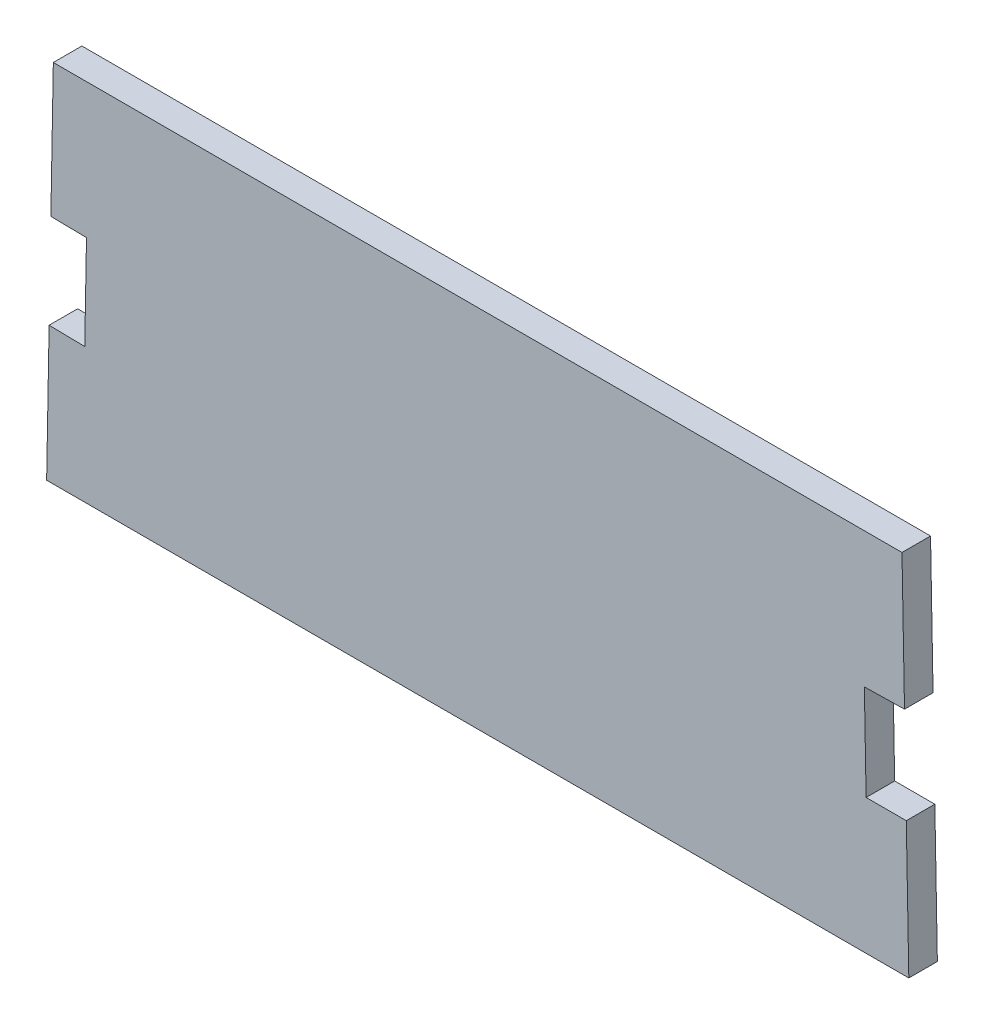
ISO-10303-21;
HEADER;
FILE_DESCRIPTION(('STEP AP214'),'2;1');
FILE_NAME('part.step','',(''),(''),'','','');
FILE_SCHEMA(('AUTOMOTIVE_DESIGN { 1 0 10303 214 1 1 1 1 }'));
ENDSEC;
DATA;
#1=APPLICATION_CONTEXT('core data for automotive mechanical design processes');
#2=APPLICATION_PROTOCOL_DEFINITION('international standard','automotive_design',2000,#1);
#3=PRODUCT_CONTEXT('',#1,'mechanical');
#4=PRODUCT('Part','Part','',(#3));
#5=PRODUCT_RELATED_PRODUCT_CATEGORY('part','',(#4));
#6=PRODUCT_DEFINITION_FORMATION('','',#4);
#7=PRODUCT_DEFINITION_CONTEXT('part definition',#1,'design');
#8=PRODUCT_DEFINITION('design','',#6,#7);
#9=PRODUCT_DEFINITION_SHAPE('','',#8);
#10=(LENGTH_UNIT() NAMED_UNIT(*) SI_UNIT(.MILLI.,.METRE.));
#11=(NAMED_UNIT(*) PLANE_ANGLE_UNIT() SI_UNIT($,.RADIAN.));
#12=(NAMED_UNIT(*) SI_UNIT($,.STERADIAN.) SOLID_ANGLE_UNIT());
#13=UNCERTAINTY_MEASURE_WITH_UNIT(LENGTH_MEASURE(1.E-05),#10,'distance_accuracy_value','');
#14=(GEOMETRIC_REPRESENTATION_CONTEXT(3) GLOBAL_UNCERTAINTY_ASSIGNED_CONTEXT((#13)) GLOBAL_UNIT_ASSIGNED_CONTEXT((#10,
#11,#12)) REPRESENTATION_CONTEXT('',''));
#15=CARTESIAN_POINT('',(0.,0.,0.));
#16=DIRECTION('',(0.,0.,1.));
#17=DIRECTION('',(1.,0.,0.));
#18=AXIS2_PLACEMENT_3D('',#15,#16,#17);
#19=CARTESIAN_POINT('',(-22.7861972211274,2.56628579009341,1.524));
#20=DIRECTION('',(0.999832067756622,-0.0183258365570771,0.));
#21=DIRECTION('',(0.0183258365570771,0.999832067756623,0.));
#22=AXIS2_PLACEMENT_3D('',#19,#20,#21);
#23=PLANE('',#22);
#24=DIRECTION('',(-0.0183258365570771,-0.999832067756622,0.));
#25=VECTOR('',#24,1.);
#26=CARTESIAN_POINT('',(-22.7861972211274,2.56628579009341,0.));
#27=LINE('',#26,#25);
#28=CARTESIAN_POINT('',(-22.6546157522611,9.7451871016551,0.));
#29=VERTEX_POINT('',#28);
#30=CARTESIAN_POINT('',(-22.7861972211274,2.56628579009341,0.));
#31=VERTEX_POINT('',#30);
#32=EDGE_CURVE('E154',#29,#31,#27,.T.);
#33=ORIENTED_EDGE('',*,*,#32,.T.);
#34=DIRECTION('',(0.,0.,-1.));
#35=VECTOR('',#34,1.);
#36=CARTESIAN_POINT('',(-22.7861972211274,2.56628579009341,1.524));
#37=LINE('',#36,#35);
#38=CARTESIAN_POINT('',(-22.7861972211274,2.56628579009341,1.524));
#39=VERTEX_POINT('',#38);
#40=EDGE_CURVE('E11',#39,#31,#37,.T.);
#41=ORIENTED_EDGE('',*,*,#40,.F.);
#42=DIRECTION('',(-0.0183258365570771,-0.999832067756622,0.));
#43=VECTOR('',#42,1.);
#44=CARTESIAN_POINT('',(-22.7861972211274,2.56628579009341,1.524));
#45=LINE('',#44,#43);
#46=CARTESIAN_POINT('',(-22.6546157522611,9.7451871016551,1.524));
#47=VERTEX_POINT('',#46);
#48=EDGE_CURVE('E176',#47,#39,#45,.T.);
#49=ORIENTED_EDGE('',*,*,#48,.F.);
#50=DIRECTION('',(0.,0.,-1.));
#51=VECTOR('',#50,1.);
#52=CARTESIAN_POINT('',(-22.6546157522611,9.7451871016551,1.524));
#53=LINE('',#52,#51);
#54=EDGE_CURVE('E150',#47,#29,#53,.T.);
#55=ORIENTED_EDGE('',*,*,#54,.T.);
#56=EDGE_LOOP('',(#33,#41,#49,#55));
#57=FACE_BOUND('',#56,.T.);
#58=ADVANCED_FACE('F34',(#57),#23,.F.);
#59=CARTESIAN_POINT('',(-22.7861972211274,2.56628579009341,1.524));
#60=DIRECTION('',(0.018325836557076,0.999832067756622,0.));
#61=DIRECTION('',(-0.999832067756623,0.018325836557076,0.));
#62=AXIS2_PLACEMENT_3D('',#59,#60,#61);
#63=PLANE('',#62);
#64=DIRECTION('',(0.999832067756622,-0.018325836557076,0.));
#65=VECTOR('',#64,1.);
#66=CARTESIAN_POINT('',(-22.7861972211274,2.56628579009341,0.));
#67=LINE('',#66,#65);
#68=CARTESIAN_POINT('',(-20.884043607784,2.53142137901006,0.));
#69=VERTEX_POINT('',#68);
#70=EDGE_CURVE('E157',#31,#69,#67,.T.);
#71=ORIENTED_EDGE('',*,*,#70,.T.);
#72=DIRECTION('',(0.,0.,-1.));
#73=VECTOR('',#72,1.);
#74=CARTESIAN_POINT('',(-20.884043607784,2.53142137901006,1.524));
#75=LINE('',#74,#73);
#76=CARTESIAN_POINT('',(-20.884043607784,2.53142137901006,1.524));
#77=VERTEX_POINT('',#76);
#78=EDGE_CURVE('E42',#77,#69,#75,.T.);
#79=ORIENTED_EDGE('',*,*,#78,.F.);
#80=DIRECTION('',(0.999832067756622,-0.018325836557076,0.));
#81=VECTOR('',#80,1.);
#82=CARTESIAN_POINT('',(-22.7861972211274,2.56628579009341,1.524));
#83=LINE('',#82,#81);
#84=EDGE_CURVE('E105',#39,#77,#83,.T.);
#85=ORIENTED_EDGE('',*,*,#84,.F.);
#86=ORIENTED_EDGE('',*,*,#40,.T.);
#87=EDGE_LOOP('',(#71,#79,#85,#86));
#88=FACE_BOUND('',#87,.T.);
#89=ADVANCED_FACE('F254',(#88),#63,.F.);
#90=CARTESIAN_POINT('',(-20.884043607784,2.53142137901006,1.524));
#91=DIRECTION('',(0.999832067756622,-0.0183258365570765,0.));
#92=DIRECTION('',(0.0183258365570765,0.999832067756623,0.));
#93=AXIS2_PLACEMENT_3D('',#90,#91,#92);
#94=PLANE('',#93);
#95=DIRECTION('',(-0.0183258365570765,-0.999832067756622,0.));
#96=VECTOR('',#95,1.);
#97=CARTESIAN_POINT('',(-20.884043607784,2.53142137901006,0.));
#98=LINE('',#97,#96);
#99=CARTESIAN_POINT('',(-20.9771388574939,-2.54772552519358,0.));
#100=VERTEX_POINT('',#99);
#101=EDGE_CURVE('E159',#69,#100,#98,.T.);
#102=ORIENTED_EDGE('',*,*,#101,.T.);
#103=DIRECTION('',(0.,0.,-1.));
#104=VECTOR('',#103,1.);
#105=CARTESIAN_POINT('',(-20.9771388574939,-2.54772552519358,1.524));
#106=LINE('',#105,#104);
#107=CARTESIAN_POINT('',(-20.9771388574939,-2.54772552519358,1.524));
#108=VERTEX_POINT('',#107);
#109=EDGE_CURVE('E195',#108,#100,#106,.T.);
#110=ORIENTED_EDGE('',*,*,#109,.F.);
#111=DIRECTION('',(-0.0183258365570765,-0.999832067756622,0.));
#112=VECTOR('',#111,1.);
#113=CARTESIAN_POINT('',(-20.884043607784,2.53142137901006,1.524));
#114=LINE('',#113,#112);
#115=EDGE_CURVE('E203',#77,#108,#114,.T.);
#116=ORIENTED_EDGE('',*,*,#115,.F.);
#117=ORIENTED_EDGE('',*,*,#78,.T.);
#118=EDGE_LOOP('',(#102,#110,#116,#117));
#119=FACE_BOUND('',#118,.T.);
#120=ADVANCED_FACE('F201',(#119),#94,.F.);
#121=CARTESIAN_POINT('',(-20.9771388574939,-2.54772552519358,1.524));
#122=DIRECTION('',(-0.018325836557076,-0.999832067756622,0.));
#123=DIRECTION('',(0.999832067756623,-0.018325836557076,0.));
#124=AXIS2_PLACEMENT_3D('',#121,#122,#123);
#125=PLANE('',#124);
#126=DIRECTION('',(-0.999832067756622,0.018325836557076,0.));
#127=VECTOR('',#126,1.);
#128=CARTESIAN_POINT('',(-20.9771388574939,-2.54772552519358,0.));
#129=LINE('',#128,#127);
#130=CARTESIAN_POINT('',(-22.8792924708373,-2.51286111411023,0.));
#131=VERTEX_POINT('',#130);
#132=EDGE_CURVE('E161',#100,#131,#129,.T.);
#133=ORIENTED_EDGE('',*,*,#132,.T.);
#134=DIRECTION('',(0.,0.,-1.));
#135=VECTOR('',#134,1.);
#136=CARTESIAN_POINT('',(-22.8792924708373,-2.51286111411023,1.524));
#137=LINE('',#136,#135);
#138=CARTESIAN_POINT('',(-22.8792924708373,-2.51286111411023,1.524));
#139=VERTEX_POINT('',#138);
#140=EDGE_CURVE('E192',#139,#131,#137,.T.);
#141=ORIENTED_EDGE('',*,*,#140,.F.);
#142=DIRECTION('',(-0.999832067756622,0.018325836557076,0.));
#143=VECTOR('',#142,1.);
#144=CARTESIAN_POINT('',(-20.9771388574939,-2.54772552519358,1.524));
#145=LINE('',#144,#143);
#146=EDGE_CURVE('E221',#108,#139,#145,.T.);
#147=ORIENTED_EDGE('',*,*,#146,.F.);
#148=ORIENTED_EDGE('',*,*,#109,.T.);
#149=EDGE_LOOP('',(#133,#141,#147,#148));
#150=FACE_BOUND('',#149,.T.);
#151=ADVANCED_FACE('F212',(#150),#125,.F.);
#152=CARTESIAN_POINT('',(-23.0118531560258,-9.7451871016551,1.524));
#153=DIRECTION('',(0.999832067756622,-0.0183258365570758,0.));
#154=DIRECTION('',(0.0183258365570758,0.999832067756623,0.));
#155=AXIS2_PLACEMENT_3D('',#152,#153,#154);
#156=PLANE('',#155);
#157=DIRECTION('',(-0.0183258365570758,-0.999832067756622,0.));
#158=VECTOR('',#157,1.);
#159=CARTESIAN_POINT('',(-23.0118531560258,-9.7451871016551,0.));
#160=LINE('',#159,#158);
#161=CARTESIAN_POINT('',(-23.0118531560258,-9.7451871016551,0.));
#162=VERTEX_POINT('',#161);
#163=EDGE_CURVE('E163',#131,#162,#160,.T.);
#164=ORIENTED_EDGE('',*,*,#163,.T.);
#165=DIRECTION('',(0.,0.,-1.));
#166=VECTOR('',#165,1.);
#167=CARTESIAN_POINT('',(-23.0118531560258,-9.7451871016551,1.524));
#168=LINE('',#167,#166);
#169=CARTESIAN_POINT('',(-23.0118531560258,-9.7451871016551,1.524));
#170=VERTEX_POINT('',#169);
#171=EDGE_CURVE('E189',#170,#162,#168,.T.);
#172=ORIENTED_EDGE('',*,*,#171,.F.);
#173=DIRECTION('',(-0.0183258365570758,-0.999832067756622,0.));
#174=VECTOR('',#173,1.);
#175=CARTESIAN_POINT('',(-23.0118531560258,-9.7451871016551,1.524));
#176=LINE('',#175,#174);
#177=EDGE_CURVE('E218',#139,#170,#176,.T.);
#178=ORIENTED_EDGE('',*,*,#177,.F.);
#179=ORIENTED_EDGE('',*,*,#140,.T.);
#180=EDGE_LOOP('',(#164,#172,#178,#179));
#181=FACE_BOUND('',#180,.T.);
#182=ADVANCED_FACE('F216',(#181),#156,.F.);
#183=CARTESIAN_POINT('',(-23.0118531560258,-9.7451871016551,1.524));
#184=DIRECTION('',(0.,1.,0.));
#185=DIRECTION('',(0.,0.,1.));
#186=AXIS2_PLACEMENT_3D('',#183,#184,#185);
#187=PLANE('',#186);
#188=DIRECTION('',(1.,0.,0.));
#189=VECTOR('',#188,1.);
#190=CARTESIAN_POINT('',(-23.0118531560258,-9.7451871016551,0.));
#191=LINE('',#190,#189);
#192=CARTESIAN_POINT('',(23.0118531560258,-9.7451871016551,0.));
#193=VERTEX_POINT('',#192);
#194=EDGE_CURVE('E165',#162,#193,#191,.T.);
#195=ORIENTED_EDGE('',*,*,#194,.T.);
#196=DIRECTION('',(0.,0.,-1.));
#197=VECTOR('',#196,1.);
#198=CARTESIAN_POINT('',(23.0118531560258,-9.7451871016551,1.524));
#199=LINE('',#198,#197);
#200=CARTESIAN_POINT('',(23.0118531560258,-9.7451871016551,1.524));
#201=VERTEX_POINT('',#200);
#202=EDGE_CURVE('E186',#201,#193,#199,.T.);
#203=ORIENTED_EDGE('',*,*,#202,.F.);
#204=DIRECTION('',(1.,0.,0.));
#205=VECTOR('',#204,1.);
#206=CARTESIAN_POINT('',(-23.0118531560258,-9.7451871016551,1.524));
#207=LINE('',#206,#205);
#208=EDGE_CURVE('E220',#170,#201,#207,.T.);
#209=ORIENTED_EDGE('',*,*,#208,.F.);
#210=ORIENTED_EDGE('',*,*,#171,.T.);
#211=EDGE_LOOP('',(#195,#203,#209,#210));
#212=FACE_BOUND('',#211,.T.);
#213=ADVANCED_FACE('F267',(#212),#187,.F.);
#214=CARTESIAN_POINT('',(23.0118531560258,-9.7451871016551,1.524));
#215=DIRECTION('',(-0.999825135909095,-0.0187002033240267,0.));
#216=DIRECTION('',(0.0187002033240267,-0.999825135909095,0.));
#217=AXIS2_PLACEMENT_3D('',#214,#215,#216);
#218=PLANE('',#217);
#219=DIRECTION('',(-0.0187002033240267,0.999825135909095,0.));
#220=VECTOR('',#219,1.);
#221=CARTESIAN_POINT('',(23.0118531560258,-9.7451871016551,0.));
#222=LINE('',#221,#220);
#223=CARTESIAN_POINT('',(22.8770831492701,-2.53957345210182,0.));
#224=VERTEX_POINT('',#223);
#225=EDGE_CURVE('E167',#193,#224,#222,.T.);
#226=ORIENTED_EDGE('',*,*,#225,.T.);
#227=DIRECTION('',(0.,0.,-1.));
#228=VECTOR('',#227,1.);
#229=CARTESIAN_POINT('',(22.8770831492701,-2.53957345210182,1.524));
#230=LINE('',#229,#228);
#231=CARTESIAN_POINT('',(22.8770831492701,-2.53957345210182,1.524));
#232=VERTEX_POINT('',#231);
#233=EDGE_CURVE('E183',#232,#224,#230,.T.);
#234=ORIENTED_EDGE('',*,*,#233,.F.);
#235=DIRECTION('',(-0.0187002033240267,0.999825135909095,0.));
#236=VECTOR('',#235,1.);
#237=CARTESIAN_POINT('',(23.0118531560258,-9.7451871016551,1.524));
#238=LINE('',#237,#236);
#239=EDGE_CURVE('E223',#201,#232,#238,.T.);
#240=ORIENTED_EDGE('',*,*,#239,.F.);
#241=ORIENTED_EDGE('',*,*,#202,.T.);
#242=EDGE_LOOP('',(#226,#234,#240,#241));
#243=FACE_BOUND('',#242,.T.);
#244=ADVANCED_FACE('F270',(#243),#218,.F.);
#245=CARTESIAN_POINT('',(20.731983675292,-2.53957345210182,1.524));
#246=DIRECTION('',(0.,-1.,0.));
#247=DIRECTION('',(0.,0.,-1.));
#248=AXIS2_PLACEMENT_3D('',#245,#246,#247);
#249=PLANE('',#248);
#250=DIRECTION('',(-1.,0.,0.));
#251=VECTOR('',#250,1.);
#252=CARTESIAN_POINT('',(20.731983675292,-2.53957345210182,0.));
#253=LINE('',#252,#251);
#254=CARTESIAN_POINT('',(20.731983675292,-2.53957345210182,0.));
#255=VERTEX_POINT('',#254);
#256=EDGE_CURVE('E169',#224,#255,#253,.T.);
#257=ORIENTED_EDGE('',*,*,#256,.T.);
#258=DIRECTION('',(0.,0.,-1.));
#259=VECTOR('',#258,1.);
#260=CARTESIAN_POINT('',(20.731983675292,-2.53957345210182,1.524));
#261=LINE('',#260,#259);
#262=CARTESIAN_POINT('',(20.731983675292,-2.53957345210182,1.524));
#263=VERTEX_POINT('',#262);
#264=EDGE_CURVE('E180',#263,#255,#261,.T.);
#265=ORIENTED_EDGE('',*,*,#264,.F.);
#266=DIRECTION('',(-1.,0.,0.));
#267=VECTOR('',#266,1.);
#268=CARTESIAN_POINT('',(20.731983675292,-2.53957345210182,1.524));
#269=LINE('',#268,#267);
#270=EDGE_CURVE('E229',#232,#263,#269,.T.);
#271=ORIENTED_EDGE('',*,*,#270,.F.);
#272=ORIENTED_EDGE('',*,*,#233,.T.);
#273=EDGE_LOOP('',(#257,#265,#271,#272));
#274=FACE_BOUND('',#273,.T.);
#275=ADVANCED_FACE('F235',(#274),#249,.F.);
#276=CARTESIAN_POINT('',(20.6391296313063,2.52641360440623,1.524));
#277=DIRECTION('',(-0.999832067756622,-0.0183258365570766,0.));
#278=DIRECTION('',(0.0183258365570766,-0.999832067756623,0.));
#279=AXIS2_PLACEMENT_3D('',#276,#277,#278);
#280=PLANE('',#279);
#281=DIRECTION('',(-0.0183258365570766,0.999832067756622,0.));
#282=VECTOR('',#281,1.);
#283=CARTESIAN_POINT('',(20.6391296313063,2.52641360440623,0.));
#284=LINE('',#283,#282);
#285=CARTESIAN_POINT('',(20.6391296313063,2.52641360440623,0.));
#286=VERTEX_POINT('',#285);
#287=EDGE_CURVE('E171',#255,#286,#284,.T.);
#288=ORIENTED_EDGE('',*,*,#287,.T.);
#289=DIRECTION('',(0.,0.,-1.));
#290=VECTOR('',#289,1.);
#291=CARTESIAN_POINT('',(20.6391296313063,2.52641360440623,1.524));
#292=LINE('',#291,#290);
#293=CARTESIAN_POINT('',(20.6391296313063,2.52641360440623,1.524));
#294=VERTEX_POINT('',#293);
#295=EDGE_CURVE('E145',#294,#286,#292,.T.);
#296=ORIENTED_EDGE('',*,*,#295,.F.);
#297=DIRECTION('',(-0.0183258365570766,0.999832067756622,0.));
#298=VECTOR('',#297,1.);
#299=CARTESIAN_POINT('',(20.6391296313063,2.52641360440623,1.524));
#300=LINE('',#299,#298);
#301=EDGE_CURVE('E136',#263,#294,#300,.T.);
#302=ORIENTED_EDGE('',*,*,#301,.F.);
#303=ORIENTED_EDGE('',*,*,#264,.T.);
#304=EDGE_LOOP('',(#288,#296,#302,#303));
#305=FACE_BOUND('',#304,.T.);
#306=ADVANCED_FACE('F239',(#305),#280,.F.);
#307=CARTESIAN_POINT('',(22.7815971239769,2.56568270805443,1.524));
#308=DIRECTION('',(-0.0183258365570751,0.999832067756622,0.));
#309=DIRECTION('',(-0.999832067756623,-0.0183258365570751,0.));
#310=AXIS2_PLACEMENT_3D('',#307,#308,#309);
#311=PLANE('',#310);
#312=DIRECTION('',(0.999832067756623,0.0183258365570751,0.));
#313=VECTOR('',#312,1.);
#314=CARTESIAN_POINT('',(22.7815971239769,2.56568270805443,0.));
#315=LINE('',#314,#313);
#316=CARTESIAN_POINT('',(22.7815971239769,2.56568270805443,0.));
#317=VERTEX_POINT('',#316);
#318=EDGE_CURVE('E144',#286,#317,#315,.T.);
#319=ORIENTED_EDGE('',*,*,#318,.T.);
#320=DIRECTION('',(0.,0.,-1.));
#321=VECTOR('',#320,1.);
#322=CARTESIAN_POINT('',(22.7815971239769,2.56568270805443,1.524));
#323=LINE('',#322,#321);
#324=CARTESIAN_POINT('',(22.7815971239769,2.56568270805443,1.524));
#325=VERTEX_POINT('',#324);
#326=EDGE_CURVE('E141',#325,#317,#323,.T.);
#327=ORIENTED_EDGE('',*,*,#326,.F.);
#328=DIRECTION('',(0.999832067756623,0.0183258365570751,0.));
#329=VECTOR('',#328,1.);
#330=CARTESIAN_POINT('',(22.7815971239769,2.56568270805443,1.524));
#331=LINE('',#330,#329);
#332=EDGE_CURVE('E130',#294,#325,#331,.T.);
#333=ORIENTED_EDGE('',*,*,#332,.F.);
#334=ORIENTED_EDGE('',*,*,#295,.T.);
#335=EDGE_LOOP('',(#319,#327,#333,#334));
#336=FACE_BOUND('',#335,.T.);
#337=ADVANCED_FACE('F142',(#336),#311,.F.);
#338=CARTESIAN_POINT('',(22.7815971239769,2.56568270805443,1.524));
#339=DIRECTION('',(-0.999825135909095,-0.0187002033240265,0.));
#340=DIRECTION('',(0.0187002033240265,-0.999825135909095,0.));
#341=AXIS2_PLACEMENT_3D('',#338,#339,#340);
#342=PLANE('',#341);
#343=DIRECTION('',(-0.0187002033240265,0.999825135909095,0.));
#344=VECTOR('',#343,1.);
#345=CARTESIAN_POINT('',(22.7815971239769,2.56568270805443,0.));
#346=LINE('',#345,#344);
#347=CARTESIAN_POINT('',(22.6473154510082,9.7451871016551,0.));
#348=VERTEX_POINT('',#347);
#349=EDGE_CURVE('E91',#317,#348,#346,.T.);
#350=ORIENTED_EDGE('',*,*,#349,.T.);
#351=DIRECTION('',(0.,0.,-1.));
#352=VECTOR('',#351,1.);
#353=CARTESIAN_POINT('',(22.6473154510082,9.7451871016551,1.524));
#354=LINE('',#353,#352);
#355=CARTESIAN_POINT('',(22.6473154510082,9.7451871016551,1.524));
#356=VERTEX_POINT('',#355);
#357=EDGE_CURVE('E146',#356,#348,#354,.T.);
#358=ORIENTED_EDGE('',*,*,#357,.F.);
#359=DIRECTION('',(-0.0187002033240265,0.999825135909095,0.));
#360=VECTOR('',#359,1.);
#361=CARTESIAN_POINT('',(22.7815971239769,2.56568270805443,1.524));
#362=LINE('',#361,#360);
#363=EDGE_CURVE('E134',#325,#356,#362,.T.);
#364=ORIENTED_EDGE('',*,*,#363,.F.);
#365=ORIENTED_EDGE('',*,*,#326,.T.);
#366=EDGE_LOOP('',(#350,#358,#364,#365));
#367=FACE_BOUND('',#366,.T.);
#368=ADVANCED_FACE('F148',(#367),#342,.F.);
#369=CARTESIAN_POINT('',(-22.6546157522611,9.7451871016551,1.524));
#370=DIRECTION('',(0.,-1.,0.));
#371=DIRECTION('',(0.,0.,-1.));
#372=AXIS2_PLACEMENT_3D('',#369,#370,#371);
#373=PLANE('',#372);
#374=DIRECTION('',(-1.,0.,0.));
#375=VECTOR('',#374,1.);
#376=CARTESIAN_POINT('',(-22.6546157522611,9.7451871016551,0.));
#377=LINE('',#376,#375);
#378=EDGE_CURVE('E97',#348,#29,#377,.T.);
#379=ORIENTED_EDGE('',*,*,#378,.T.);
#380=ORIENTED_EDGE('',*,*,#54,.F.);
#381=DIRECTION('',(-1.,0.,0.));
#382=VECTOR('',#381,1.);
#383=CARTESIAN_POINT('',(-22.6546157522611,9.7451871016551,1.524));
#384=LINE('',#383,#382);
#385=EDGE_CURVE('E50',#356,#47,#384,.T.);
#386=ORIENTED_EDGE('',*,*,#385,.F.);
#387=ORIENTED_EDGE('',*,*,#357,.T.);
#388=EDGE_LOOP('',(#379,#380,#386,#387));
#389=FACE_BOUND('',#388,.T.);
#390=ADVANCED_FACE('F243',(#389),#373,.F.);
#391=CARTESIAN_POINT('',(0.,0.,1.524));
#392=DIRECTION('',(0.,0.,1.));
#393=DIRECTION('',(1.,0.,0.));
#394=AXIS2_PLACEMENT_3D('',#391,#392,#393);
#395=PLANE('',#394);
#396=ORIENTED_EDGE('',*,*,#48,.T.);
#397=ORIENTED_EDGE('',*,*,#84,.T.);
#398=ORIENTED_EDGE('',*,*,#115,.T.);
#399=ORIENTED_EDGE('',*,*,#146,.T.);
#400=ORIENTED_EDGE('',*,*,#177,.T.);
#401=ORIENTED_EDGE('',*,*,#208,.T.);
#402=ORIENTED_EDGE('',*,*,#239,.T.);
#403=ORIENTED_EDGE('',*,*,#270,.T.);
#404=ORIENTED_EDGE('',*,*,#301,.T.);
#405=ORIENTED_EDGE('',*,*,#332,.T.);
#406=ORIENTED_EDGE('',*,*,#363,.T.);
#407=ORIENTED_EDGE('',*,*,#385,.T.);
#408=EDGE_LOOP('',(#396,#397,#398,#399,#400,#401,#402,#403,#404,#405,#406,#407));
#409=FACE_BOUND('',#408,.T.);
#410=ADVANCED_FACE('F132',(#409),#395,.T.);
#411=CARTESIAN_POINT('',(0.,0.,0.));
#412=DIRECTION('',(0.,0.,1.));
#413=DIRECTION('',(1.,0.,0.));
#414=AXIS2_PLACEMENT_3D('',#411,#412,#413);
#415=PLANE('',#414);
#416=ORIENTED_EDGE('',*,*,#32,.F.);
#417=ORIENTED_EDGE('',*,*,#378,.F.);
#418=ORIENTED_EDGE('',*,*,#349,.F.);
#419=ORIENTED_EDGE('',*,*,#318,.F.);
#420=ORIENTED_EDGE('',*,*,#287,.F.);
#421=ORIENTED_EDGE('',*,*,#256,.F.);
#422=ORIENTED_EDGE('',*,*,#225,.F.);
#423=ORIENTED_EDGE('',*,*,#194,.F.);
#424=ORIENTED_EDGE('',*,*,#163,.F.);
#425=ORIENTED_EDGE('',*,*,#132,.F.);
#426=ORIENTED_EDGE('',*,*,#101,.F.);
#427=ORIENTED_EDGE('',*,*,#70,.F.);
#428=EDGE_LOOP('',(#416,#417,#418,#419,#420,#421,#422,#423,#424,#425,#426,#427));
#429=FACE_BOUND('',#428,.T.);
#430=ADVANCED_FACE('F207',(#429),#415,.F.);
#431=CLOSED_SHELL('',(#58,#89,#120,#151,#182,#213,#244,#275,#306,#337,#368,#390,#410,#430));
#432=MANIFOLD_SOLID_BREP('B2',#431);
#433=ADVANCED_BREP_SHAPE_REPRESENTATION('',(#18,#432),#14);
#434=SHAPE_DEFINITION_REPRESENTATION(#9,#433);
ENDSEC;
END-ISO-10303-21;
